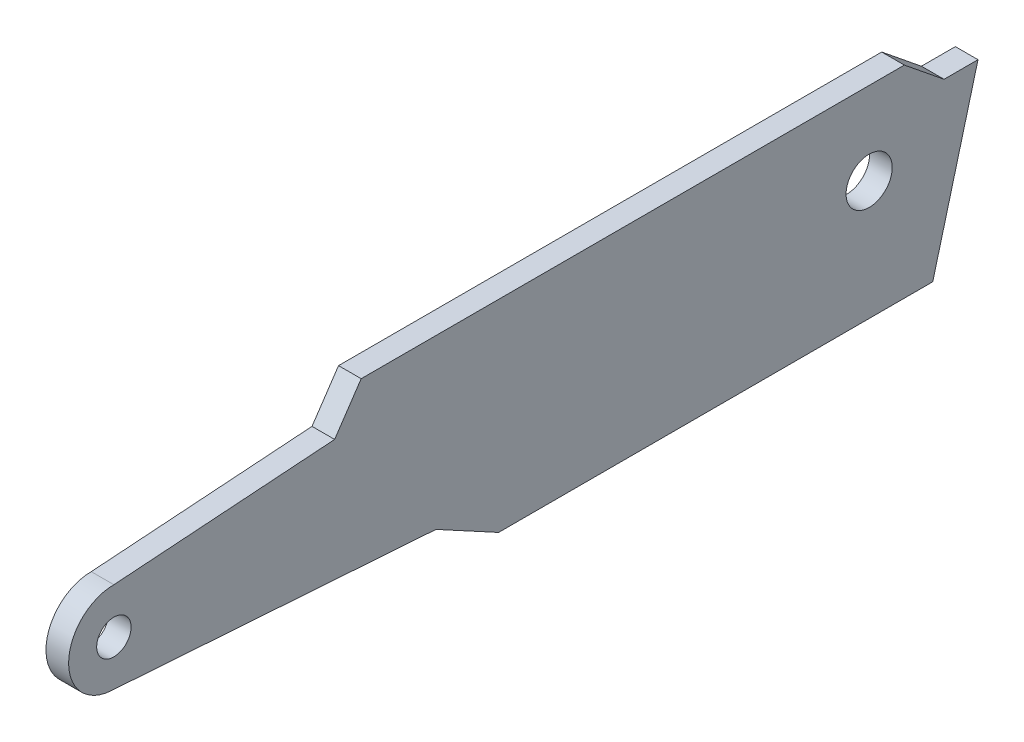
ISO-10303-21;
HEADER;
FILE_DESCRIPTION(('STEP AP214'),'2;1');
FILE_NAME('part.step','',(''),(''),'','','');
FILE_SCHEMA(('AUTOMOTIVE_DESIGN { 1 0 10303 214 1 1 1 1 }'));
ENDSEC;
DATA;
#1=APPLICATION_CONTEXT('core data for automotive mechanical design processes');
#2=APPLICATION_PROTOCOL_DEFINITION('international standard','automotive_design',2000,#1);
#3=PRODUCT_CONTEXT('',#1,'mechanical');
#4=PRODUCT('Part','Part','',(#3));
#5=PRODUCT_RELATED_PRODUCT_CATEGORY('part','',(#4));
#6=PRODUCT_DEFINITION_FORMATION('','',#4);
#7=PRODUCT_DEFINITION_CONTEXT('part definition',#1,'design');
#8=PRODUCT_DEFINITION('design','',#6,#7);
#9=PRODUCT_DEFINITION_SHAPE('','',#8);
#10=(LENGTH_UNIT() NAMED_UNIT(*) SI_UNIT(.MILLI.,.METRE.));
#11=(NAMED_UNIT(*) PLANE_ANGLE_UNIT() SI_UNIT($,.RADIAN.));
#12=(NAMED_UNIT(*) SI_UNIT($,.STERADIAN.) SOLID_ANGLE_UNIT());
#13=UNCERTAINTY_MEASURE_WITH_UNIT(LENGTH_MEASURE(1.E-05),#10,'distance_accuracy_value','');
#14=(GEOMETRIC_REPRESENTATION_CONTEXT(3) GLOBAL_UNCERTAINTY_ASSIGNED_CONTEXT((#13)) GLOBAL_UNIT_ASSIGNED_CONTEXT((#10,
#11,#12)) REPRESENTATION_CONTEXT('',''));
#15=CARTESIAN_POINT('',(0.,0.,0.));
#16=DIRECTION('',(0.,0.,1.));
#17=DIRECTION('',(1.,0.,0.));
#18=AXIS2_PLACEMENT_3D('',#15,#16,#17);
#19=CARTESIAN_POINT('',(1.5875,17.3980736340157,-157.994813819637));
#20=DIRECTION('',(0.,0.997564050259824,0.0697564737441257));
#21=DIRECTION('',(0.,-0.0697564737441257,0.997564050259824));
#22=AXIS2_PLACEMENT_3D('',#19,#20,#21);
#23=PLANE('',#22);
#24=DIRECTION('',(0.,0.0697564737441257,-0.997564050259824));
#25=VECTOR('',#24,1.);
#26=CARTESIAN_POINT('',(-1.5875,17.3980736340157,-157.994813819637));
#27=LINE('',#26,#25);
#28=CARTESIAN_POINT('',(-1.5875,6.34999999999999,0.));
#29=VERTEX_POINT('',#28);
#30=CARTESIAN_POINT('',(-1.5875,8.51554278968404,-30.9687046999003));
#31=VERTEX_POINT('',#30);
#32=EDGE_CURVE('E144',#29,#31,#27,.T.);
#33=ORIENTED_EDGE('',*,*,#32,.F.);
#34=DIRECTION('',(-1.,0.,0.));
#35=VECTOR('',#34,1.);
#36=CARTESIAN_POINT('',(1.5875,6.34999999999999,0.));
#37=LINE('',#36,#35);
#38=CARTESIAN_POINT('',(1.5875,6.34999999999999,0.));
#39=VERTEX_POINT('',#38);
#40=EDGE_CURVE('E11',#39,#29,#37,.T.);
#41=ORIENTED_EDGE('',*,*,#40,.F.);
#42=DIRECTION('',(0.,0.0697564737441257,-0.997564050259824));
#43=VECTOR('',#42,1.);
#44=CARTESIAN_POINT('',(1.5875,17.3980736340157,-157.994813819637));
#45=LINE('',#44,#43);
#46=CARTESIAN_POINT('',(1.5875,8.51554278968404,-30.9687046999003));
#47=VERTEX_POINT('',#46);
#48=EDGE_CURVE('E247',#39,#47,#45,.T.);
#49=ORIENTED_EDGE('',*,*,#48,.T.);
#50=DIRECTION('',(-1.,0.,0.));
#51=VECTOR('',#50,1.);
#52=CARTESIAN_POINT('',(1.5875,8.51554278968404,-30.9687046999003));
#53=LINE('',#52,#51);
#54=EDGE_CURVE('E51',#47,#31,#53,.T.);
#55=ORIENTED_EDGE('',*,*,#54,.T.);
#56=EDGE_LOOP('',(#33,#41,#49,#55));
#57=FACE_BOUND('',#56,.T.);
#58=ADVANCED_FACE('F34',(#57),#23,.T.);
#59=CARTESIAN_POINT('',(1.5875,0.,0.));
#60=DIRECTION('',(-1.,0.,0.));
#61=DIRECTION('',(0.,0.,1.));
#62=AXIS2_PLACEMENT_3D('',#59,#60,#61);
#63=CYLINDRICAL_SURFACE('',#62,6.35);
#64=CARTESIAN_POINT('',(-1.5875,0.,0.));
#65=DIRECTION('',(1.,0.,0.));
#66=DIRECTION('',(0.,0.,-1.));
#67=AXIS2_PLACEMENT_3D('',#64,#65,#66);
#68=CIRCLE('',#67,6.35);
#69=CARTESIAN_POINT('',(-1.5875,-6.33453171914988,0.442953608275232));
#70=VERTEX_POINT('',#69);
#71=EDGE_CURVE('E147',#29,#70,#68,.T.);
#72=ORIENTED_EDGE('',*,*,#71,.T.);
#73=DIRECTION('',(-1.,0.,0.));
#74=VECTOR('',#73,1.);
#75=CARTESIAN_POINT('',(1.5875,-6.33453171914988,0.442953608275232));
#76=LINE('',#75,#74);
#77=CARTESIAN_POINT('',(1.5875,-6.33453171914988,0.442953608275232));
#78=VERTEX_POINT('',#77);
#79=EDGE_CURVE('E43',#78,#70,#76,.T.);
#80=ORIENTED_EDGE('',*,*,#79,.F.);
#81=CARTESIAN_POINT('',(1.5875,0.,0.));
#82=DIRECTION('',(1.,0.,0.));
#83=DIRECTION('',(0.,0.,-1.));
#84=AXIS2_PLACEMENT_3D('',#81,#82,#83);
#85=CIRCLE('',#84,6.35);
#86=EDGE_CURVE('E249',#39,#78,#85,.T.);
#87=ORIENTED_EDGE('',*,*,#86,.F.);
#88=ORIENTED_EDGE('',*,*,#40,.T.);
#89=EDGE_LOOP('',(#72,#80,#87,#88));
#90=FACE_BOUND('',#89,.T.);
#91=ADVANCED_FACE('F191',(#90),#63,.T.);
#92=CARTESIAN_POINT('',(1.5875,-17.4147401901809,-158.011409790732));
#93=DIRECTION('',(0.,0.997564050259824,-0.0697564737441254));
#94=DIRECTION('',(0.,0.0697564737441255,0.997564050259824));
#95=AXIS2_PLACEMENT_3D('',#92,#93,#94);
#96=PLANE('',#95);
#97=DIRECTION('',(0.,-0.0697564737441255,-0.997564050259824));
#98=VECTOR('',#97,1.);
#99=CARTESIAN_POINT('',(-1.5875,-17.4147401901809,-158.011409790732));
#100=LINE('',#99,#98);
#101=CARTESIAN_POINT('',(-1.5875,-9.525,-45.1828684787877));
#102=VERTEX_POINT('',#101);
#103=EDGE_CURVE('E150',#70,#102,#100,.T.);
#104=ORIENTED_EDGE('',*,*,#103,.T.);
#105=DIRECTION('',(-1.,0.,0.));
#106=VECTOR('',#105,1.);
#107=CARTESIAN_POINT('',(1.5875,-9.525,-45.1828684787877));
#108=LINE('',#107,#106);
#109=CARTESIAN_POINT('',(1.5875,-9.525,-45.1828684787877));
#110=VERTEX_POINT('',#109);
#111=EDGE_CURVE('E181',#110,#102,#108,.T.);
#112=ORIENTED_EDGE('',*,*,#111,.F.);
#113=DIRECTION('',(0.,-0.0697564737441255,-0.997564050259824));
#114=VECTOR('',#113,1.);
#115=CARTESIAN_POINT('',(1.5875,-17.4147401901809,-158.011409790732));
#116=LINE('',#115,#114);
#117=EDGE_CURVE('E187',#78,#110,#116,.T.);
#118=ORIENTED_EDGE('',*,*,#117,.F.);
#119=ORIENTED_EDGE('',*,*,#79,.T.);
#120=EDGE_LOOP('',(#104,#112,#118,#119));
#121=FACE_BOUND('',#120,.T.);
#122=ADVANCED_FACE('F185',(#121),#96,.F.);
#123=CARTESIAN_POINT('',(1.5875,-55.1515136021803,-129.414744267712));
#124=DIRECTION('',(0.,-0.879287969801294,0.476290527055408));
#125=DIRECTION('',(0.,-0.476290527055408,-0.879287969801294));
#126=AXIS2_PLACEMENT_3D('',#123,#124,#125);
#127=PLANE('',#126);
#128=DIRECTION('',(0.,0.476290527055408,0.879287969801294));
#129=VECTOR('',#128,1.);
#130=CARTESIAN_POINT('',(-1.5875,-55.1515136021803,-129.414744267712));
#131=LINE('',#130,#129);
#132=CARTESIAN_POINT('',(-1.5875,-14.2875,-53.975));
#133=VERTEX_POINT('',#132);
#134=EDGE_CURVE('E153',#133,#102,#131,.T.);
#135=ORIENTED_EDGE('',*,*,#134,.F.);
#136=DIRECTION('',(-1.,0.,0.));
#137=VECTOR('',#136,1.);
#138=CARTESIAN_POINT('',(1.5875,-14.2875,-53.975));
#139=LINE('',#138,#137);
#140=CARTESIAN_POINT('',(1.5875,-14.2875,-53.975));
#141=VERTEX_POINT('',#140);
#142=EDGE_CURVE('E179',#141,#133,#139,.T.);
#143=ORIENTED_EDGE('',*,*,#142,.F.);
#144=DIRECTION('',(0.,0.476290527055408,0.879287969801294));
#145=VECTOR('',#144,1.);
#146=CARTESIAN_POINT('',(1.5875,-55.1515136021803,-129.414744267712));
#147=LINE('',#146,#145);
#148=EDGE_CURVE('E252',#141,#110,#147,.T.);
#149=ORIENTED_EDGE('',*,*,#148,.T.);
#150=ORIENTED_EDGE('',*,*,#111,.T.);
#151=EDGE_LOOP('',(#135,#143,#149,#150));
#152=FACE_BOUND('',#151,.T.);
#153=ADVANCED_FACE('F202',(#152),#127,.T.);
#154=CARTESIAN_POINT('',(1.5875,-14.2875,-159.220286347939));
#155=DIRECTION('',(0.,-1.,0.));
#156=DIRECTION('',(0.,0.,-1.));
#157=AXIS2_PLACEMENT_3D('',#154,#155,#156);
#158=PLANE('',#157);
#159=DIRECTION('',(0.,0.,1.));
#160=VECTOR('',#159,1.);
#161=CARTESIAN_POINT('',(-1.5875,-14.2875,-159.220286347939));
#162=LINE('',#161,#160);
#163=CARTESIAN_POINT('',(-1.5875,-14.2875,-114.8715));
#164=VERTEX_POINT('',#163);
#165=EDGE_CURVE('E156',#164,#133,#162,.T.);
#166=ORIENTED_EDGE('',*,*,#165,.F.);
#167=DIRECTION('',(-1.,0.,0.));
#168=VECTOR('',#167,1.);
#169=CARTESIAN_POINT('',(1.5875,-14.2875,-114.8715));
#170=LINE('',#169,#168);
#171=CARTESIAN_POINT('',(1.5875,-14.2875,-114.8715));
#172=VERTEX_POINT('',#171);
#173=EDGE_CURVE('E177',#172,#164,#170,.T.);
#174=ORIENTED_EDGE('',*,*,#173,.F.);
#175=DIRECTION('',(0.,0.,1.));
#176=VECTOR('',#175,1.);
#177=CARTESIAN_POINT('',(1.5875,-14.2875,-159.220286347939));
#178=LINE('',#177,#176);
#179=EDGE_CURVE('E255',#172,#141,#178,.T.);
#180=ORIENTED_EDGE('',*,*,#179,.T.);
#181=ORIENTED_EDGE('',*,*,#142,.T.);
#182=EDGE_LOOP('',(#166,#174,#180,#181));
#183=FACE_BOUND('',#182,.T.);
#184=ADVANCED_FACE('F205',(#183),#158,.T.);
#185=CARTESIAN_POINT('',(1.5875,9.97407543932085,-121.341253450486));
#186=DIRECTION('',(0.,-0.257662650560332,-0.966234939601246));
#187=DIRECTION('',(0.,0.966234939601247,-0.257662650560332));
#188=AXIS2_PLACEMENT_3D('',#185,#186,#187);
#189=PLANE('',#188);
#190=DIRECTION('',(0.,-0.966234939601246,0.257662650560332));
#191=VECTOR('',#190,1.);
#192=CARTESIAN_POINT('',(-1.5875,9.97407543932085,-121.341253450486));
#193=LINE('',#192,#191);
#194=CARTESIAN_POINT('',(-1.5875,9.525,-121.2215));
#195=VERTEX_POINT('',#194);
#196=EDGE_CURVE('E159',#195,#164,#193,.T.);
#197=ORIENTED_EDGE('',*,*,#196,.F.);
#198=DIRECTION('',(-1.,0.,0.));
#199=VECTOR('',#198,1.);
#200=CARTESIAN_POINT('',(1.5875,9.525,-121.2215));
#201=LINE('',#200,#199);
#202=CARTESIAN_POINT('',(1.5875,9.525,-121.2215));
#203=VERTEX_POINT('',#202);
#204=EDGE_CURVE('E175',#203,#195,#201,.T.);
#205=ORIENTED_EDGE('',*,*,#204,.F.);
#206=DIRECTION('',(0.,-0.966234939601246,0.257662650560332));
#207=VECTOR('',#206,1.);
#208=CARTESIAN_POINT('',(1.5875,9.97407543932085,-121.341253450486));
#209=LINE('',#208,#207);
#210=EDGE_CURVE('E258',#203,#172,#209,.T.);
#211=ORIENTED_EDGE('',*,*,#210,.T.);
#212=ORIENTED_EDGE('',*,*,#173,.T.);
#213=EDGE_LOOP('',(#197,#205,#211,#212));
#214=FACE_BOUND('',#213,.T.);
#215=ADVANCED_FACE('F209',(#214),#189,.T.);
#216=CARTESIAN_POINT('',(1.5875,9.52500000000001,-159.220286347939));
#217=DIRECTION('',(0.,1.,0.));
#218=DIRECTION('',(0.,0.,1.));
#219=AXIS2_PLACEMENT_3D('',#216,#217,#218);
#220=PLANE('',#219);
#221=DIRECTION('',(0.,0.,-1.));
#222=VECTOR('',#221,1.);
#223=CARTESIAN_POINT('',(-1.5875,9.52500000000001,-159.220286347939));
#224=LINE('',#223,#222);
#225=CARTESIAN_POINT('',(-1.5875,9.52499999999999,-116.459));
#226=VERTEX_POINT('',#225);
#227=EDGE_CURVE('E162',#226,#195,#224,.T.);
#228=ORIENTED_EDGE('',*,*,#227,.F.);
#229=DIRECTION('',(-1.,0.,0.));
#230=VECTOR('',#229,1.);
#231=CARTESIAN_POINT('',(1.5875,9.52499999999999,-116.459));
#232=LINE('',#231,#230);
#233=CARTESIAN_POINT('',(1.5875,9.52499999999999,-116.459));
#234=VERTEX_POINT('',#233);
#235=EDGE_CURVE('E122',#234,#226,#232,.T.);
#236=ORIENTED_EDGE('',*,*,#235,.F.);
#237=DIRECTION('',(0.,0.,-1.));
#238=VECTOR('',#237,1.);
#239=CARTESIAN_POINT('',(1.5875,9.52500000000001,-159.220286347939));
#240=LINE('',#239,#238);
#241=EDGE_CURVE('E133',#234,#203,#240,.T.);
#242=ORIENTED_EDGE('',*,*,#241,.T.);
#243=ORIENTED_EDGE('',*,*,#204,.T.);
#244=EDGE_LOOP('',(#228,#236,#242,#243));
#245=FACE_BOUND('',#244,.T.);
#246=ADVANCED_FACE('F213',(#245),#220,.T.);
#247=CARTESIAN_POINT('',(1.5875,-15.2096703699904,-147.008450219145));
#248=DIRECTION('',(0.,0.77719307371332,-0.629262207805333));
#249=DIRECTION('',(0.,0.629262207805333,0.77719307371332));
#250=AXIS2_PLACEMENT_3D('',#247,#248,#249);
#251=PLANE('',#250);
#252=DIRECTION('',(0.,-0.629262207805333,-0.77719307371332));
#253=VECTOR('',#252,1.);
#254=CARTESIAN_POINT('',(-1.5875,-15.2096703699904,-147.008450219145));
#255=LINE('',#254,#253);
#256=CARTESIAN_POINT('',(-1.5875,14.0335,-110.89061383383));
#257=VERTEX_POINT('',#256);
#258=EDGE_CURVE('E118',#257,#226,#255,.T.);
#259=ORIENTED_EDGE('',*,*,#258,.F.);
#260=DIRECTION('',(-1.,0.,0.));
#261=VECTOR('',#260,1.);
#262=CARTESIAN_POINT('',(1.5875,14.0335,-110.89061383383));
#263=LINE('',#262,#261);
#264=CARTESIAN_POINT('',(1.5875,14.0335,-110.89061383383));
#265=VERTEX_POINT('',#264);
#266=EDGE_CURVE('E113',#265,#257,#263,.T.);
#267=ORIENTED_EDGE('',*,*,#266,.F.);
#268=DIRECTION('',(0.,-0.629262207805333,-0.77719307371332));
#269=VECTOR('',#268,1.);
#270=CARTESIAN_POINT('',(1.5875,-15.2096703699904,-147.008450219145));
#271=LINE('',#270,#269);
#272=EDGE_CURVE('E116',#265,#234,#271,.T.);
#273=ORIENTED_EDGE('',*,*,#272,.T.);
#274=ORIENTED_EDGE('',*,*,#235,.T.);
#275=EDGE_LOOP('',(#259,#267,#273,#274));
#276=FACE_BOUND('',#275,.T.);
#277=ADVANCED_FACE('F115',(#276),#251,.T.);
#278=CARTESIAN_POINT('',(1.5875,14.0335,-159.220286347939));
#279=DIRECTION('',(0.,1.,0.));
#280=DIRECTION('',(0.,0.,1.));
#281=AXIS2_PLACEMENT_3D('',#278,#279,#280);
#282=PLANE('',#281);
#283=DIRECTION('',(0.,0.,-1.));
#284=VECTOR('',#283,1.);
#285=CARTESIAN_POINT('',(-1.5875,14.0335,-159.220286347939));
#286=LINE('',#285,#284);
#287=CARTESIAN_POINT('',(-1.5875,14.0335,-34.6906138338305));
#288=VERTEX_POINT('',#287);
#289=EDGE_CURVE('E166',#288,#257,#286,.T.);
#290=ORIENTED_EDGE('',*,*,#289,.F.);
#291=DIRECTION('',(-1.,0.,0.));
#292=VECTOR('',#291,1.);
#293=CARTESIAN_POINT('',(1.5875,14.0335,-34.6906138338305));
#294=LINE('',#293,#292);
#295=CARTESIAN_POINT('',(1.5875,14.0335,-34.6906138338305));
#296=VERTEX_POINT('',#295);
#297=EDGE_CURVE('E82',#296,#288,#294,.T.);
#298=ORIENTED_EDGE('',*,*,#297,.F.);
#299=DIRECTION('',(0.,0.,-1.));
#300=VECTOR('',#299,1.);
#301=CARTESIAN_POINT('',(1.5875,14.0335,-159.220286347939));
#302=LINE('',#301,#300);
#303=EDGE_CURVE('E130',#296,#265,#302,.T.);
#304=ORIENTED_EDGE('',*,*,#303,.T.);
#305=ORIENTED_EDGE('',*,*,#266,.T.);
#306=EDGE_LOOP('',(#290,#298,#304,#305));
#307=FACE_BOUND('',#306,.T.);
#308=ADVANCED_FACE('F135',(#307),#282,.T.);
#309=CARTESIAN_POINT('',(1.5875,0.,0.));
#310=DIRECTION('',(-1.,0.,0.));
#311=DIRECTION('',(0.,0.,1.));
#312=AXIS2_PLACEMENT_3D('',#309,#310,#311);
#313=CYLINDRICAL_SURFACE('',#312,2.413);
#314=CARTESIAN_POINT('',(1.5875,0.,0.));
#315=DIRECTION('',(1.,0.,0.));
#316=DIRECTION('',(0.,0.,-1.));
#317=AXIS2_PLACEMENT_3D('',#314,#315,#316);
#318=CIRCLE('',#317,2.413);
#319=CARTESIAN_POINT('',(1.5875,0.,-2.413));
#320=VERTEX_POINT('',#319);
#321=EDGE_CURVE('E171',#320,#320,#318,.T.);
#322=ORIENTED_EDGE('',*,*,#321,.T.);
#323=EDGE_LOOP('',(#322));
#324=FACE_BOUND('',#323,.T.);
#325=CARTESIAN_POINT('',(-1.5875,0.,0.));
#326=DIRECTION('',(1.,0.,0.));
#327=DIRECTION('',(0.,0.,-1.));
#328=AXIS2_PLACEMENT_3D('',#325,#326,#327);
#329=CIRCLE('',#328,2.413);
#330=CARTESIAN_POINT('',(-1.5875,0.,-2.413));
#331=VERTEX_POINT('',#330);
#332=EDGE_CURVE('E141',#331,#331,#329,.T.);
#333=ORIENTED_EDGE('',*,*,#332,.F.);
#334=EDGE_LOOP('',(#333));
#335=FACE_BOUND('',#334,.T.);
#336=ADVANCED_FACE('F36',(#324,#335),#313,.F.);
#337=CARTESIAN_POINT('',(1.5875,62.0318925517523,-67.0659384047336));
#338=DIRECTION('',(0.,0.559192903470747,0.829037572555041));
#339=DIRECTION('',(0.,-0.829037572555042,0.559192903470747));
#340=AXIS2_PLACEMENT_3D('',#337,#338,#339);
#341=PLANE('',#340);
#342=DIRECTION('',(0.,0.829037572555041,-0.559192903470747));
#343=VECTOR('',#342,1.);
#344=CARTESIAN_POINT('',(-1.5875,62.0318925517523,-67.0659384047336));
#345=LINE('',#344,#343);
#346=EDGE_CURVE('E168',#31,#288,#345,.T.);
#347=ORIENTED_EDGE('',*,*,#346,.F.);
#348=ORIENTED_EDGE('',*,*,#54,.F.);
#349=DIRECTION('',(0.,0.829037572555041,-0.559192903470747));
#350=VECTOR('',#349,1.);
#351=CARTESIAN_POINT('',(1.5875,62.0318925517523,-67.0659384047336));
#352=LINE('',#351,#350);
#353=EDGE_CURVE('E136',#47,#296,#352,.T.);
#354=ORIENTED_EDGE('',*,*,#353,.T.);
#355=ORIENTED_EDGE('',*,*,#297,.T.);
#356=EDGE_LOOP('',(#347,#348,#354,#355));
#357=FACE_BOUND('',#356,.T.);
#358=ADVANCED_FACE('F222',(#357),#341,.T.);
#359=CARTESIAN_POINT('',(1.5875,-0.126999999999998,-159.220286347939));
#360=DIRECTION('',(1.,0.,0.));
#361=DIRECTION('',(0.,0.,-1.));
#362=AXIS2_PLACEMENT_3D('',#359,#360,#361);
#363=PLANE('',#362);
#364=CARTESIAN_POINT('',(1.5875,2.44346887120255,-105.951769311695));
#365=DIRECTION('',(1.,0.,0.));
#366=DIRECTION('',(0.,0.,-1.));
#367=AXIS2_PLACEMENT_3D('',#364,#365,#366);
#368=CIRCLE('',#367,3.23850000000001);
#369=CARTESIAN_POINT('',(1.5875,2.44346887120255,-109.190269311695));
#370=VERTEX_POINT('',#369);
#371=EDGE_CURVE('E241',#370,#370,#368,.T.);
#372=ORIENTED_EDGE('',*,*,#371,.F.);
#373=EDGE_LOOP('',(#372));
#374=FACE_BOUND('',#373,.T.);
#375=ORIENTED_EDGE('',*,*,#321,.F.);
#376=EDGE_LOOP('',(#375));
#377=FACE_BOUND('',#376,.T.);
#378=ORIENTED_EDGE('',*,*,#48,.F.);
#379=ORIENTED_EDGE('',*,*,#86,.T.);
#380=ORIENTED_EDGE('',*,*,#117,.T.);
#381=ORIENTED_EDGE('',*,*,#148,.F.);
#382=ORIENTED_EDGE('',*,*,#179,.F.);
#383=ORIENTED_EDGE('',*,*,#210,.F.);
#384=ORIENTED_EDGE('',*,*,#241,.F.);
#385=ORIENTED_EDGE('',*,*,#272,.F.);
#386=ORIENTED_EDGE('',*,*,#303,.F.);
#387=ORIENTED_EDGE('',*,*,#353,.F.);
#388=EDGE_LOOP('',(#378,#379,#380,#381,#382,#383,#384,#385,#386,#387));
#389=FACE_BOUND('',#388,.T.);
#390=ADVANCED_FACE('F128',(#374,#377,#389),#363,.T.);
#391=CARTESIAN_POINT('',(-1.5875,-0.126999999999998,-159.220286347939));
#392=DIRECTION('',(1.,0.,0.));
#393=DIRECTION('',(0.,0.,-1.));
#394=AXIS2_PLACEMENT_3D('',#391,#392,#393);
#395=PLANE('',#394);
#396=CARTESIAN_POINT('',(-1.5875,2.44346887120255,-105.951769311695));
#397=DIRECTION('',(1.,0.,0.));
#398=DIRECTION('',(0.,0.,-1.));
#399=AXIS2_PLACEMENT_3D('',#396,#397,#398);
#400=CIRCLE('',#399,3.23850000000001);
#401=CARTESIAN_POINT('',(-1.5875,2.44346887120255,-109.190269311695));
#402=VERTEX_POINT('',#401);
#403=EDGE_CURVE('E145',#402,#402,#400,.T.);
#404=ORIENTED_EDGE('',*,*,#403,.T.);
#405=EDGE_LOOP('',(#404));
#406=FACE_BOUND('',#405,.T.);
#407=ORIENTED_EDGE('',*,*,#332,.T.);
#408=EDGE_LOOP('',(#407));
#409=FACE_BOUND('',#408,.T.);
#410=ORIENTED_EDGE('',*,*,#32,.T.);
#411=ORIENTED_EDGE('',*,*,#346,.T.);
#412=ORIENTED_EDGE('',*,*,#289,.T.);
#413=ORIENTED_EDGE('',*,*,#258,.T.);
#414=ORIENTED_EDGE('',*,*,#227,.T.);
#415=ORIENTED_EDGE('',*,*,#196,.T.);
#416=ORIENTED_EDGE('',*,*,#165,.T.);
#417=ORIENTED_EDGE('',*,*,#134,.T.);
#418=ORIENTED_EDGE('',*,*,#103,.F.);
#419=ORIENTED_EDGE('',*,*,#71,.F.);
#420=EDGE_LOOP('',(#410,#411,#412,#413,#414,#415,#416,#417,#418,#419));
#421=FACE_BOUND('',#420,.T.);
#422=ADVANCED_FACE('F193',(#406,#409,#421),#395,.F.);
#423=CARTESIAN_POINT('',(-1.5875,2.44346887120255,-105.951769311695));
#424=DIRECTION('',(1.,0.,0.));
#425=DIRECTION('',(0.,0.,-1.));
#426=AXIS2_PLACEMENT_3D('',#423,#424,#425);
#427=CYLINDRICAL_SURFACE('',#426,3.23850000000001);
#428=ORIENTED_EDGE('',*,*,#403,.F.);
#429=EDGE_LOOP('',(#428));
#430=FACE_BOUND('',#429,.T.);
#431=ORIENTED_EDGE('',*,*,#371,.T.);
#432=EDGE_LOOP('',(#431));
#433=FACE_BOUND('',#432,.T.);
#434=ADVANCED_FACE('F227',(#430,#433),#427,.F.);
#435=CLOSED_SHELL('',(#58,#91,#122,#153,#184,#215,#246,#277,#308,#336,#358,#390,#422,#434));
#436=MANIFOLD_SOLID_BREP('B2',#435);
#437=ADVANCED_BREP_SHAPE_REPRESENTATION('',(#18,#436),#14);
#438=SHAPE_DEFINITION_REPRESENTATION(#9,#437);
ENDSEC;
END-ISO-10303-21;
